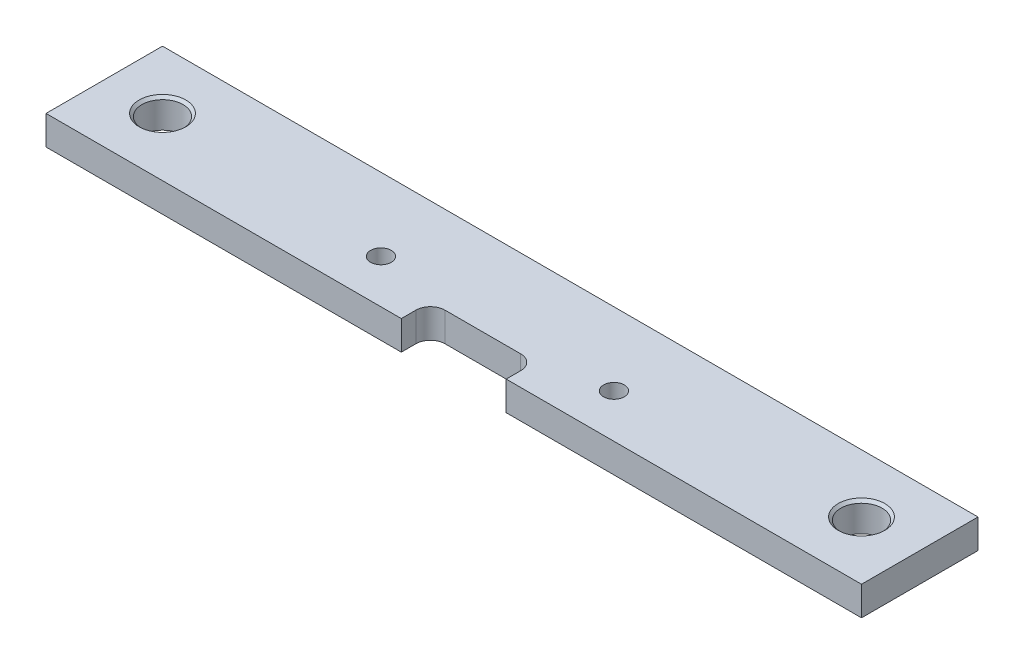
ISO-10303-21;
HEADER;
FILE_DESCRIPTION(('STEP AP214'),'2;1');
FILE_NAME('part.step','',(''),(''),'','','');
FILE_SCHEMA(('AUTOMOTIVE_DESIGN { 1 0 10303 214 1 1 1 1 }'));
ENDSEC;
DATA;
#1=APPLICATION_CONTEXT('core data for automotive mechanical design processes');
#2=APPLICATION_PROTOCOL_DEFINITION('international standard','automotive_design',2000,#1);
#3=PRODUCT_CONTEXT('',#1,'mechanical');
#4=PRODUCT('Part','Part','',(#3));
#5=PRODUCT_RELATED_PRODUCT_CATEGORY('part','',(#4));
#6=PRODUCT_DEFINITION_FORMATION('','',#4);
#7=PRODUCT_DEFINITION_CONTEXT('part definition',#1,'design');
#8=PRODUCT_DEFINITION('design','',#6,#7);
#9=PRODUCT_DEFINITION_SHAPE('','',#8);
#10=(LENGTH_UNIT() NAMED_UNIT(*) SI_UNIT(.MILLI.,.METRE.));
#11=(NAMED_UNIT(*) PLANE_ANGLE_UNIT() SI_UNIT($,.RADIAN.));
#12=(NAMED_UNIT(*) SI_UNIT($,.STERADIAN.) SOLID_ANGLE_UNIT());
#13=UNCERTAINTY_MEASURE_WITH_UNIT(LENGTH_MEASURE(1.E-05),#10,'distance_accuracy_value','');
#14=(GEOMETRIC_REPRESENTATION_CONTEXT(3) GLOBAL_UNCERTAINTY_ASSIGNED_CONTEXT((#13)) GLOBAL_UNIT_ASSIGNED_CONTEXT((#10,
#11,#12)) REPRESENTATION_CONTEXT('',''));
#15=CARTESIAN_POINT('',(0.,0.,0.));
#16=DIRECTION('',(0.,0.,1.));
#17=DIRECTION('',(1.,0.,0.));
#18=AXIS2_PLACEMENT_3D('',#15,#16,#17);
#19=CARTESIAN_POINT('',(-44.45,3.175,6.35));
#20=DIRECTION('',(0.,0.,-1.));
#21=DIRECTION('',(-1.,0.,0.));
#22=AXIS2_PLACEMENT_3D('',#19,#20,#21);
#23=PLANE('',#22);
#24=DIRECTION('',(1.,0.,0.));
#25=VECTOR('',#24,1.);
#26=CARTESIAN_POINT('',(-44.45,3.175,6.35));
#27=LINE('',#26,#25);
#28=CARTESIAN_POINT('',(5.715,3.175,6.35));
#29=VERTEX_POINT('',#28);
#30=CARTESIAN_POINT('',(44.45,3.175,6.35));
#31=VERTEX_POINT('',#30);
#32=EDGE_CURVE('E136',#29,#31,#27,.T.);
#33=ORIENTED_EDGE('',*,*,#32,.F.);
#34=DIRECTION('',(0.,-1.,0.));
#35=VECTOR('',#34,1.);
#36=CARTESIAN_POINT('',(5.715,3.175,6.35));
#37=LINE('',#36,#35);
#38=CARTESIAN_POINT('',(5.715,0.,6.35));
#39=VERTEX_POINT('',#38);
#40=EDGE_CURVE('E126',#29,#39,#37,.T.);
#41=ORIENTED_EDGE('',*,*,#40,.T.);
#42=DIRECTION('',(1.,0.,0.));
#43=VECTOR('',#42,1.);
#44=CARTESIAN_POINT('',(-44.45,0.,6.35));
#45=LINE('',#44,#43);
#46=CARTESIAN_POINT('',(44.45,0.,6.35));
#47=VERTEX_POINT('',#46);
#48=EDGE_CURVE('E152',#39,#47,#45,.T.);
#49=ORIENTED_EDGE('',*,*,#48,.T.);
#50=DIRECTION('',(0.,-1.,0.));
#51=VECTOR('',#50,1.);
#52=CARTESIAN_POINT('',(44.45,3.175,6.35));
#53=LINE('',#52,#51);
#54=EDGE_CURVE('E135',#31,#47,#53,.T.);
#55=ORIENTED_EDGE('',*,*,#54,.F.);
#56=EDGE_LOOP('',(#33,#41,#49,#55));
#57=FACE_BOUND('',#56,.T.);
#58=ADVANCED_FACE('F32',(#57),#23,.F.);
#59=CARTESIAN_POINT('',(44.45,3.175,-6.35));
#60=DIRECTION('',(-1.,0.,0.));
#61=DIRECTION('',(0.,0.,1.));
#62=AXIS2_PLACEMENT_3D('',#59,#60,#61);
#63=PLANE('',#62);
#64=DIRECTION('',(0.,0.,-1.));
#65=VECTOR('',#64,1.);
#66=CARTESIAN_POINT('',(44.45,0.,-6.35));
#67=LINE('',#66,#65);
#68=CARTESIAN_POINT('',(44.45,0.,-6.35));
#69=VERTEX_POINT('',#68);
#70=EDGE_CURVE('E144',#47,#69,#67,.T.);
#71=ORIENTED_EDGE('',*,*,#70,.T.);
#72=DIRECTION('',(0.,-1.,0.));
#73=VECTOR('',#72,1.);
#74=CARTESIAN_POINT('',(44.45,3.175,-6.35));
#75=LINE('',#74,#73);
#76=CARTESIAN_POINT('',(44.45,3.175,-6.35));
#77=VERTEX_POINT('',#76);
#78=EDGE_CURVE('E159',#77,#69,#75,.T.);
#79=ORIENTED_EDGE('',*,*,#78,.F.);
#80=DIRECTION('',(0.,0.,-1.));
#81=VECTOR('',#80,1.);
#82=CARTESIAN_POINT('',(44.45,3.175,-6.35));
#83=LINE('',#82,#81);
#84=EDGE_CURVE('E153',#31,#77,#83,.T.);
#85=ORIENTED_EDGE('',*,*,#84,.F.);
#86=ORIENTED_EDGE('',*,*,#54,.T.);
#87=EDGE_LOOP('',(#71,#79,#85,#86));
#88=FACE_BOUND('',#87,.T.);
#89=ADVANCED_FACE('F191',(#88),#63,.F.);
#90=CARTESIAN_POINT('',(-44.45,3.175,-6.35));
#91=DIRECTION('',(0.,0.,1.));
#92=DIRECTION('',(1.,0.,0.));
#93=AXIS2_PLACEMENT_3D('',#90,#91,#92);
#94=PLANE('',#93);
#95=DIRECTION('',(-1.,0.,0.));
#96=VECTOR('',#95,1.);
#97=CARTESIAN_POINT('',(-44.45,0.,-6.35));
#98=LINE('',#97,#96);
#99=CARTESIAN_POINT('',(-44.45,0.,-6.35));
#100=VERTEX_POINT('',#99);
#101=EDGE_CURVE('E147',#69,#100,#98,.T.);
#102=ORIENTED_EDGE('',*,*,#101,.T.);
#103=DIRECTION('',(0.,-1.,0.));
#104=VECTOR('',#103,1.);
#105=CARTESIAN_POINT('',(-44.45,3.175,-6.35));
#106=LINE('',#105,#104);
#107=CARTESIAN_POINT('',(-44.45,3.175,-6.35));
#108=VERTEX_POINT('',#107);
#109=EDGE_CURVE('E156',#108,#100,#106,.T.);
#110=ORIENTED_EDGE('',*,*,#109,.F.);
#111=DIRECTION('',(-1.,0.,0.));
#112=VECTOR('',#111,1.);
#113=CARTESIAN_POINT('',(-44.45,3.175,-6.35));
#114=LINE('',#113,#112);
#115=EDGE_CURVE('E258',#77,#108,#114,.T.);
#116=ORIENTED_EDGE('',*,*,#115,.F.);
#117=ORIENTED_EDGE('',*,*,#78,.T.);
#118=EDGE_LOOP('',(#102,#110,#116,#117));
#119=FACE_BOUND('',#118,.T.);
#120=ADVANCED_FACE('F197',(#119),#94,.F.);
#121=CARTESIAN_POINT('',(-44.45,3.175,-6.35));
#122=DIRECTION('',(1.,0.,0.));
#123=DIRECTION('',(0.,0.,-1.));
#124=AXIS2_PLACEMENT_3D('',#121,#122,#123);
#125=PLANE('',#124);
#126=DIRECTION('',(0.,0.,1.));
#127=VECTOR('',#126,1.);
#128=CARTESIAN_POINT('',(-44.45,0.,-6.35));
#129=LINE('',#128,#127);
#130=CARTESIAN_POINT('',(-44.45,0.,6.35));
#131=VERTEX_POINT('',#130);
#132=EDGE_CURVE('E150',#100,#131,#129,.T.);
#133=ORIENTED_EDGE('',*,*,#132,.T.);
#134=DIRECTION('',(0.,-1.,0.));
#135=VECTOR('',#134,1.);
#136=CARTESIAN_POINT('',(-44.45,3.175,6.35));
#137=LINE('',#136,#135);
#138=CARTESIAN_POINT('',(-44.45,3.175,6.35));
#139=VERTEX_POINT('',#138);
#140=EDGE_CURVE('E139',#139,#131,#137,.T.);
#141=ORIENTED_EDGE('',*,*,#140,.F.);
#142=DIRECTION('',(0.,0.,1.));
#143=VECTOR('',#142,1.);
#144=CARTESIAN_POINT('',(-44.45,3.175,-6.35));
#145=LINE('',#144,#143);
#146=EDGE_CURVE('E133',#108,#139,#145,.T.);
#147=ORIENTED_EDGE('',*,*,#146,.F.);
#148=ORIENTED_EDGE('',*,*,#109,.T.);
#149=EDGE_LOOP('',(#133,#141,#147,#148));
#150=FACE_BOUND('',#149,.T.);
#151=ADVANCED_FACE('F204',(#150),#125,.F.);
#152=CARTESIAN_POINT('',(-5.715,0.,6.35));
#153=VERTEX_POINT('',#152);
#154=EDGE_CURVE('E125',#131,#153,#45,.T.);
#155=ORIENTED_EDGE('',*,*,#154,.T.);
#156=DIRECTION('',(0.,1.,0.));
#157=VECTOR('',#156,1.);
#158=CARTESIAN_POINT('',(-5.715,3.175,6.35));
#159=LINE('',#158,#157);
#160=CARTESIAN_POINT('',(-5.715,3.175,6.35));
#161=VERTEX_POINT('',#160);
#162=EDGE_CURVE('E111',#153,#161,#159,.T.);
#163=ORIENTED_EDGE('',*,*,#162,.T.);
#164=EDGE_CURVE('E123',#139,#161,#27,.T.);
#165=ORIENTED_EDGE('',*,*,#164,.F.);
#166=ORIENTED_EDGE('',*,*,#140,.T.);
#167=EDGE_LOOP('',(#155,#163,#165,#166));
#168=FACE_BOUND('',#167,.T.);
#169=ADVANCED_FACE('F121',(#168),#23,.F.);
#170=CARTESIAN_POINT('',(44.45,3.175,6.35));
#171=DIRECTION('',(0.,1.,0.));
#172=DIRECTION('',(0.,0.,1.));
#173=AXIS2_PLACEMENT_3D('',#170,#171,#172);
#174=PLANE('',#173);
#175=DIRECTION('',(0.,0.,-1.));
#176=VECTOR('',#175,1.);
#177=CARTESIAN_POINT('',(5.715,3.175,3.175));
#178=LINE('',#177,#176);
#179=CARTESIAN_POINT('',(5.715,3.175,4.7625));
#180=VERTEX_POINT('',#179);
#181=EDGE_CURVE('E182',#29,#180,#178,.T.);
#182=ORIENTED_EDGE('',*,*,#181,.F.);
#183=ORIENTED_EDGE('',*,*,#32,.T.);
#184=ORIENTED_EDGE('',*,*,#84,.T.);
#185=ORIENTED_EDGE('',*,*,#115,.T.);
#186=ORIENTED_EDGE('',*,*,#146,.T.);
#187=ORIENTED_EDGE('',*,*,#164,.T.);
#188=DIRECTION('',(0.,0.,1.));
#189=VECTOR('',#188,1.);
#190=CARTESIAN_POINT('',(-5.715,3.175,3.175));
#191=LINE('',#190,#189);
#192=CARTESIAN_POINT('',(-5.715,3.175,4.7625));
#193=VERTEX_POINT('',#192);
#194=EDGE_CURVE('E108',#193,#161,#191,.T.);
#195=ORIENTED_EDGE('',*,*,#194,.F.);
#196=CARTESIAN_POINT('',(-4.1275,3.175,4.7625));
#197=DIRECTION('',(0.,1.,0.));
#198=DIRECTION('',(0.,0.,1.));
#199=AXIS2_PLACEMENT_3D('',#196,#197,#198);
#200=CIRCLE('',#199,1.5875);
#201=CARTESIAN_POINT('',(-4.1275,3.175,3.175));
#202=VERTEX_POINT('',#201);
#203=EDGE_CURVE('E40',#193,#202,#200,.F.);
#204=ORIENTED_EDGE('',*,*,#203,.T.);
#205=DIRECTION('',(-1.,0.,0.));
#206=VECTOR('',#205,1.);
#207=CARTESIAN_POINT('',(-5.715,3.175,3.175));
#208=LINE('',#207,#206);
#209=CARTESIAN_POINT('',(4.1275,3.175,3.175));
#210=VERTEX_POINT('',#209);
#211=EDGE_CURVE('E117',#210,#202,#208,.T.);
#212=ORIENTED_EDGE('',*,*,#211,.F.);
#213=CARTESIAN_POINT('',(4.1275,3.175,4.7625));
#214=DIRECTION('',(0.,1.,0.));
#215=DIRECTION('',(0.,0.,1.));
#216=AXIS2_PLACEMENT_3D('',#213,#214,#215);
#217=CIRCLE('',#216,1.5875);
#218=EDGE_CURVE('E173',#210,#180,#217,.F.);
#219=ORIENTED_EDGE('',*,*,#218,.T.);
#220=EDGE_LOOP('',(#182,#183,#184,#185,#186,#187,#195,#204,#212,#219));
#221=FACE_BOUND('',#220,.T.);
#222=CARTESIAN_POINT('',(-12.7,3.175,1.5875));
#223=DIRECTION('',(0.,1.,0.));
#224=DIRECTION('',(0.,0.,1.));
#225=AXIS2_PLACEMENT_3D('',#222,#223,#224);
#226=CIRCLE('',#225,1.13029999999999);
#227=CARTESIAN_POINT('',(-12.7,3.175,2.71779999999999));
#228=VERTEX_POINT('',#227);
#229=EDGE_CURVE('E228',#228,#228,#226,.T.);
#230=ORIENTED_EDGE('',*,*,#229,.F.);
#231=EDGE_LOOP('',(#230));
#232=FACE_BOUND('',#231,.T.);
#233=CARTESIAN_POINT('',(12.7,3.175,1.5875));
#234=DIRECTION('',(0.,1.,0.));
#235=DIRECTION('',(0.,0.,1.));
#236=AXIS2_PLACEMENT_3D('',#233,#234,#235);
#237=CIRCLE('',#236,1.13029999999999);
#238=CARTESIAN_POINT('',(12.7,3.175,2.71779999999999));
#239=VERTEX_POINT('',#238);
#240=EDGE_CURVE('E234',#239,#239,#237,.T.);
#241=ORIENTED_EDGE('',*,*,#240,.F.);
#242=EDGE_LOOP('',(#241));
#243=FACE_BOUND('',#242,.T.);
#244=CARTESIAN_POINT('',(-38.1,3.175,0.));
#245=DIRECTION('',(0.,1.,0.));
#246=DIRECTION('',(0.,0.,1.));
#247=AXIS2_PLACEMENT_3D('',#244,#245,#246);
#248=CIRCLE('',#247,2.54);
#249=CARTESIAN_POINT('',(-38.1,3.175,2.54));
#250=VERTEX_POINT('',#249);
#251=EDGE_CURVE('E240',#250,#250,#248,.T.);
#252=ORIENTED_EDGE('',*,*,#251,.F.);
#253=EDGE_LOOP('',(#252));
#254=FACE_BOUND('',#253,.T.);
#255=CARTESIAN_POINT('',(38.1,3.175,0.));
#256=DIRECTION('',(0.,1.,0.));
#257=DIRECTION('',(0.,0.,1.));
#258=AXIS2_PLACEMENT_3D('',#255,#256,#257);
#259=CIRCLE('',#258,2.54);
#260=CARTESIAN_POINT('',(38.1,3.175,2.54));
#261=VERTEX_POINT('',#260);
#262=EDGE_CURVE('E249',#261,#261,#259,.T.);
#263=ORIENTED_EDGE('',*,*,#262,.F.);
#264=EDGE_LOOP('',(#263));
#265=FACE_BOUND('',#264,.T.);
#266=ADVANCED_FACE('F130',(#221,#232,#243,#254,#265),#174,.T.);
#267=CARTESIAN_POINT('',(44.45,0.,6.35));
#268=DIRECTION('',(0.,1.,0.));
#269=DIRECTION('',(0.,0.,1.));
#270=AXIS2_PLACEMENT_3D('',#267,#268,#269);
#271=PLANE('',#270);
#272=ORIENTED_EDGE('',*,*,#48,.F.);
#273=DIRECTION('',(0.,0.,-1.));
#274=VECTOR('',#273,1.);
#275=CARTESIAN_POINT('',(5.715,0.,6.35000000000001));
#276=LINE('',#275,#274);
#277=CARTESIAN_POINT('',(5.715,0.,4.7625));
#278=VERTEX_POINT('',#277);
#279=EDGE_CURVE('E162',#39,#278,#276,.T.);
#280=ORIENTED_EDGE('',*,*,#279,.T.);
#281=CARTESIAN_POINT('',(4.1275,0.,4.7625));
#282=DIRECTION('',(0.,1.,0.));
#283=DIRECTION('',(0.,0.,1.));
#284=AXIS2_PLACEMENT_3D('',#281,#282,#283);
#285=CIRCLE('',#284,1.5875);
#286=CARTESIAN_POINT('',(4.1275,0.,3.175));
#287=VERTEX_POINT('',#286);
#288=EDGE_CURVE('E175',#278,#287,#285,.T.);
#289=ORIENTED_EDGE('',*,*,#288,.T.);
#290=DIRECTION('',(-1.,0.,0.));
#291=VECTOR('',#290,1.);
#292=CARTESIAN_POINT('',(-5.715,0.,3.175));
#293=LINE('',#292,#291);
#294=CARTESIAN_POINT('',(-4.1275,0.,3.175));
#295=VERTEX_POINT('',#294);
#296=EDGE_CURVE('E116',#287,#295,#293,.T.);
#297=ORIENTED_EDGE('',*,*,#296,.T.);
#298=CARTESIAN_POINT('',(-4.1275,0.,4.7625));
#299=DIRECTION('',(0.,1.,0.));
#300=DIRECTION('',(0.,0.,1.));
#301=AXIS2_PLACEMENT_3D('',#298,#299,#300);
#302=CIRCLE('',#301,1.5875);
#303=CARTESIAN_POINT('',(-5.715,0.,4.7625));
#304=VERTEX_POINT('',#303);
#305=EDGE_CURVE('E11',#295,#304,#302,.T.);
#306=ORIENTED_EDGE('',*,*,#305,.T.);
#307=DIRECTION('',(0.,0.,1.));
#308=VECTOR('',#307,1.);
#309=CARTESIAN_POINT('',(-5.715,0.,3.175));
#310=LINE('',#309,#308);
#311=EDGE_CURVE('E127',#304,#153,#310,.T.);
#312=ORIENTED_EDGE('',*,*,#311,.T.);
#313=ORIENTED_EDGE('',*,*,#154,.F.);
#314=ORIENTED_EDGE('',*,*,#132,.F.);
#315=ORIENTED_EDGE('',*,*,#101,.F.);
#316=ORIENTED_EDGE('',*,*,#70,.F.);
#317=EDGE_LOOP('',(#272,#280,#289,#297,#306,#312,#313,#314,#315,#316));
#318=FACE_BOUND('',#317,.T.);
#319=CARTESIAN_POINT('',(-12.7,1.18134668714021E-12,1.5875));
#320=DIRECTION('',(0.,1.,0.));
#321=DIRECTION('',(0.,0.,1.));
#322=AXIS2_PLACEMENT_3D('',#319,#320,#321);
#323=CIRCLE('',#322,1.1303);
#324=CARTESIAN_POINT('',(-12.7,1.18134668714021E-12,2.7178));
#325=VERTEX_POINT('',#324);
#326=EDGE_CURVE('E231',#325,#325,#323,.T.);
#327=ORIENTED_EDGE('',*,*,#326,.T.);
#328=EDGE_LOOP('',(#327));
#329=FACE_BOUND('',#328,.T.);
#330=CARTESIAN_POINT('',(12.7,1.18134668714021E-12,1.5875));
#331=DIRECTION('',(0.,1.,0.));
#332=DIRECTION('',(0.,0.,1.));
#333=AXIS2_PLACEMENT_3D('',#330,#331,#332);
#334=CIRCLE('',#333,1.1303);
#335=CARTESIAN_POINT('',(12.7,1.18134668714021E-12,2.7178));
#336=VERTEX_POINT('',#335);
#337=EDGE_CURVE('E237',#336,#336,#334,.T.);
#338=ORIENTED_EDGE('',*,*,#337,.T.);
#339=EDGE_LOOP('',(#338));
#340=FACE_BOUND('',#339,.T.);
#341=CARTESIAN_POINT('',(-38.1,0.,0.));
#342=DIRECTION('',(0.,1.,0.));
#343=DIRECTION('',(0.,0.,1.));
#344=AXIS2_PLACEMENT_3D('',#341,#342,#343);
#345=CIRCLE('',#344,2.2479);
#346=CARTESIAN_POINT('',(-38.1,0.,2.2479));
#347=VERTEX_POINT('',#346);
#348=EDGE_CURVE('E246',#347,#347,#345,.T.);
#349=ORIENTED_EDGE('',*,*,#348,.T.);
#350=EDGE_LOOP('',(#349));
#351=FACE_BOUND('',#350,.T.);
#352=CARTESIAN_POINT('',(38.1,0.,0.));
#353=DIRECTION('',(0.,1.,0.));
#354=DIRECTION('',(0.,0.,1.));
#355=AXIS2_PLACEMENT_3D('',#352,#353,#354);
#356=CIRCLE('',#355,2.2479);
#357=CARTESIAN_POINT('',(38.1,0.,2.2479));
#358=VERTEX_POINT('',#357);
#359=EDGE_CURVE('E148',#358,#358,#356,.T.);
#360=ORIENTED_EDGE('',*,*,#359,.T.);
#361=EDGE_LOOP('',(#360));
#362=FACE_BOUND('',#361,.T.);
#363=ADVANCED_FACE('F209',(#318,#329,#340,#351,#362),#271,.F.);
#364=CARTESIAN_POINT('',(38.1,3.175,0.));
#365=DIRECTION('',(0.,1.,0.));
#366=DIRECTION('',(0.,0.,1.));
#367=AXIS2_PLACEMENT_3D('',#364,#365,#366);
#368=CYLINDRICAL_SURFACE('',#367,2.2479);
#369=ORIENTED_EDGE('',*,*,#359,.F.);
#370=EDGE_LOOP('',(#369));
#371=FACE_BOUND('',#370,.T.);
#372=CARTESIAN_POINT('',(38.1,2.8829,0.));
#373=DIRECTION('',(0.,1.,0.));
#374=DIRECTION('',(0.,0.,1.));
#375=AXIS2_PLACEMENT_3D('',#372,#373,#374);
#376=CIRCLE('',#375,2.2479);
#377=CARTESIAN_POINT('',(38.1,2.8829,2.2479));
#378=VERTEX_POINT('',#377);
#379=EDGE_CURVE('E252',#378,#378,#376,.T.);
#380=ORIENTED_EDGE('',*,*,#379,.T.);
#381=EDGE_LOOP('',(#380));
#382=FACE_BOUND('',#381,.T.);
#383=ADVANCED_FACE('F294',(#371,#382),#368,.F.);
#384=CARTESIAN_POINT('',(38.1,3.175,0.));
#385=DIRECTION('',(0.,1.,0.));
#386=DIRECTION('',(0.,0.,1.));
#387=AXIS2_PLACEMENT_3D('',#384,#385,#386);
#388=CONICAL_SURFACE('',#387,2.54,0.785398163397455);
#389=ORIENTED_EDGE('',*,*,#379,.F.);
#390=EDGE_LOOP('',(#389));
#391=FACE_BOUND('',#390,.T.);
#392=ORIENTED_EDGE('',*,*,#262,.T.);
#393=EDGE_LOOP('',(#392));
#394=FACE_BOUND('',#393,.T.);
#395=ADVANCED_FACE('F290',(#391,#394),#388,.F.);
#396=CARTESIAN_POINT('',(-38.1,3.175,0.));
#397=DIRECTION('',(0.,1.,0.));
#398=DIRECTION('',(0.,0.,1.));
#399=AXIS2_PLACEMENT_3D('',#396,#397,#398);
#400=CYLINDRICAL_SURFACE('',#399,2.2479);
#401=ORIENTED_EDGE('',*,*,#348,.F.);
#402=EDGE_LOOP('',(#401));
#403=FACE_BOUND('',#402,.T.);
#404=CARTESIAN_POINT('',(-38.1,2.8829,0.));
#405=DIRECTION('',(0.,1.,0.));
#406=DIRECTION('',(0.,0.,1.));
#407=AXIS2_PLACEMENT_3D('',#404,#405,#406);
#408=CIRCLE('',#407,2.2479);
#409=CARTESIAN_POINT('',(-38.1,2.8829,2.2479));
#410=VERTEX_POINT('',#409);
#411=EDGE_CURVE('E243',#410,#410,#408,.T.);
#412=ORIENTED_EDGE('',*,*,#411,.T.);
#413=EDGE_LOOP('',(#412));
#414=FACE_BOUND('',#413,.T.);
#415=ADVANCED_FACE('F286',(#403,#414),#400,.F.);
#416=CARTESIAN_POINT('',(-38.1,3.175,0.));
#417=DIRECTION('',(0.,1.,0.));
#418=DIRECTION('',(0.,0.,1.));
#419=AXIS2_PLACEMENT_3D('',#416,#417,#418);
#420=CONICAL_SURFACE('',#419,2.54,0.785398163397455);
#421=ORIENTED_EDGE('',*,*,#411,.F.);
#422=EDGE_LOOP('',(#421));
#423=FACE_BOUND('',#422,.T.);
#424=ORIENTED_EDGE('',*,*,#251,.T.);
#425=EDGE_LOOP('',(#424));
#426=FACE_BOUND('',#425,.T.);
#427=ADVANCED_FACE('F282',(#423,#426),#420,.F.);
#428=CARTESIAN_POINT('',(12.7,3.175,1.5875));
#429=DIRECTION('',(0.,1.,0.));
#430=DIRECTION('',(0.,0.,1.));
#431=AXIS2_PLACEMENT_3D('',#428,#429,#430);
#432=CYLINDRICAL_SURFACE('',#431,1.13029999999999);
#433=ORIENTED_EDGE('',*,*,#337,.F.);
#434=EDGE_LOOP('',(#433));
#435=FACE_BOUND('',#434,.T.);
#436=ORIENTED_EDGE('',*,*,#240,.T.);
#437=EDGE_LOOP('',(#436));
#438=FACE_BOUND('',#437,.T.);
#439=ADVANCED_FACE('F275',(#435,#438),#432,.F.);
#440=CARTESIAN_POINT('',(-12.7,3.175,1.5875));
#441=DIRECTION('',(0.,1.,0.));
#442=DIRECTION('',(0.,0.,1.));
#443=AXIS2_PLACEMENT_3D('',#440,#441,#442);
#444=CYLINDRICAL_SURFACE('',#443,1.13029999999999);
#445=ORIENTED_EDGE('',*,*,#326,.F.);
#446=EDGE_LOOP('',(#445));
#447=FACE_BOUND('',#446,.T.);
#448=ORIENTED_EDGE('',*,*,#229,.T.);
#449=EDGE_LOOP('',(#448));
#450=FACE_BOUND('',#449,.T.);
#451=ADVANCED_FACE('F268',(#447,#450),#444,.F.);
#452=CARTESIAN_POINT('',(5.715,0.,3.175));
#453=DIRECTION('',(1.,0.,0.));
#454=DIRECTION('',(0.,0.,-1.));
#455=AXIS2_PLACEMENT_3D('',#452,#453,#454);
#456=PLANE('',#455);
#457=ORIENTED_EDGE('',*,*,#181,.T.);
#458=DIRECTION('',(0.,1.,0.));
#459=VECTOR('',#458,1.);
#460=CARTESIAN_POINT('',(5.715,0.,4.7625));
#461=LINE('',#460,#459);
#462=EDGE_CURVE('E170',#180,#278,#461,.F.);
#463=ORIENTED_EDGE('',*,*,#462,.T.);
#464=ORIENTED_EDGE('',*,*,#279,.F.);
#465=ORIENTED_EDGE('',*,*,#40,.F.);
#466=EDGE_LOOP('',(#457,#463,#464,#465));
#467=FACE_BOUND('',#466,.T.);
#468=ADVANCED_FACE('F264',(#467),#456,.F.);
#469=CARTESIAN_POINT('',(-5.715,0.,3.175));
#470=DIRECTION('',(-1.,0.,0.));
#471=DIRECTION('',(0.,0.,1.));
#472=AXIS2_PLACEMENT_3D('',#469,#470,#471);
#473=PLANE('',#472);
#474=ORIENTED_EDGE('',*,*,#311,.F.);
#475=DIRECTION('',(0.,1.,0.));
#476=VECTOR('',#475,1.);
#477=CARTESIAN_POINT('',(-5.715,3.175,4.7625));
#478=LINE('',#477,#476);
#479=EDGE_CURVE('E113',#304,#193,#478,.T.);
#480=ORIENTED_EDGE('',*,*,#479,.T.);
#481=ORIENTED_EDGE('',*,*,#194,.T.);
#482=ORIENTED_EDGE('',*,*,#162,.F.);
#483=EDGE_LOOP('',(#474,#480,#481,#482));
#484=FACE_BOUND('',#483,.T.);
#485=ADVANCED_FACE('F110',(#484),#473,.F.);
#486=CARTESIAN_POINT('',(-5.715,0.,3.175));
#487=DIRECTION('',(0.,0.,-1.));
#488=DIRECTION('',(-1.,0.,0.));
#489=AXIS2_PLACEMENT_3D('',#486,#487,#488);
#490=PLANE('',#489);
#491=ORIENTED_EDGE('',*,*,#296,.F.);
#492=DIRECTION('',(0.,1.,0.));
#493=VECTOR('',#492,1.);
#494=CARTESIAN_POINT('',(4.1275,3.175,3.175));
#495=LINE('',#494,#493);
#496=EDGE_CURVE('E167',#287,#210,#495,.T.);
#497=ORIENTED_EDGE('',*,*,#496,.T.);
#498=ORIENTED_EDGE('',*,*,#211,.T.);
#499=DIRECTION('',(0.,1.,0.));
#500=VECTOR('',#499,1.);
#501=CARTESIAN_POINT('',(-4.1275,0.,3.175));
#502=LINE('',#501,#500);
#503=EDGE_CURVE('E165',#202,#295,#502,.F.);
#504=ORIENTED_EDGE('',*,*,#503,.T.);
#505=EDGE_LOOP('',(#491,#497,#498,#504));
#506=FACE_BOUND('',#505,.T.);
#507=ADVANCED_FACE('F180',(#506),#490,.F.);
#508=CARTESIAN_POINT('',(4.1275,0.,4.7625));
#509=DIRECTION('',(0.,-1.,0.));
#510=DIRECTION('',(0.,0.,-1.));
#511=AXIS2_PLACEMENT_3D('',#508,#509,#510);
#512=CYLINDRICAL_SURFACE('',#511,1.5875);
#513=ORIENTED_EDGE('',*,*,#288,.F.);
#514=ORIENTED_EDGE('',*,*,#462,.F.);
#515=ORIENTED_EDGE('',*,*,#218,.F.);
#516=ORIENTED_EDGE('',*,*,#496,.F.);
#517=EDGE_LOOP('',(#513,#514,#515,#516));
#518=FACE_BOUND('',#517,.T.);
#519=ADVANCED_FACE('F185',(#518),#512,.F.);
#520=CARTESIAN_POINT('',(-4.1275,0.,4.7625));
#521=DIRECTION('',(0.,-1.,0.));
#522=DIRECTION('',(0.,0.,-1.));
#523=AXIS2_PLACEMENT_3D('',#520,#521,#522);
#524=CYLINDRICAL_SURFACE('',#523,1.5875);
#525=ORIENTED_EDGE('',*,*,#305,.F.);
#526=ORIENTED_EDGE('',*,*,#503,.F.);
#527=ORIENTED_EDGE('',*,*,#203,.F.);
#528=ORIENTED_EDGE('',*,*,#479,.F.);
#529=EDGE_LOOP('',(#525,#526,#527,#528));
#530=FACE_BOUND('',#529,.T.);
#531=ADVANCED_FACE('F34',(#530),#524,.F.);
#532=CLOSED_SHELL('',(#58,#89,#120,#151,#169,#266,#363,#383,#395,#415,#427,#439,#451,#468,#485,
#507,#519,#531));
#533=MANIFOLD_SOLID_BREP('B2',#532);
#534=ADVANCED_BREP_SHAPE_REPRESENTATION('',(#18,#533),#14);
#535=SHAPE_DEFINITION_REPRESENTATION(#9,#534);
ENDSEC;
END-ISO-10303-21;
